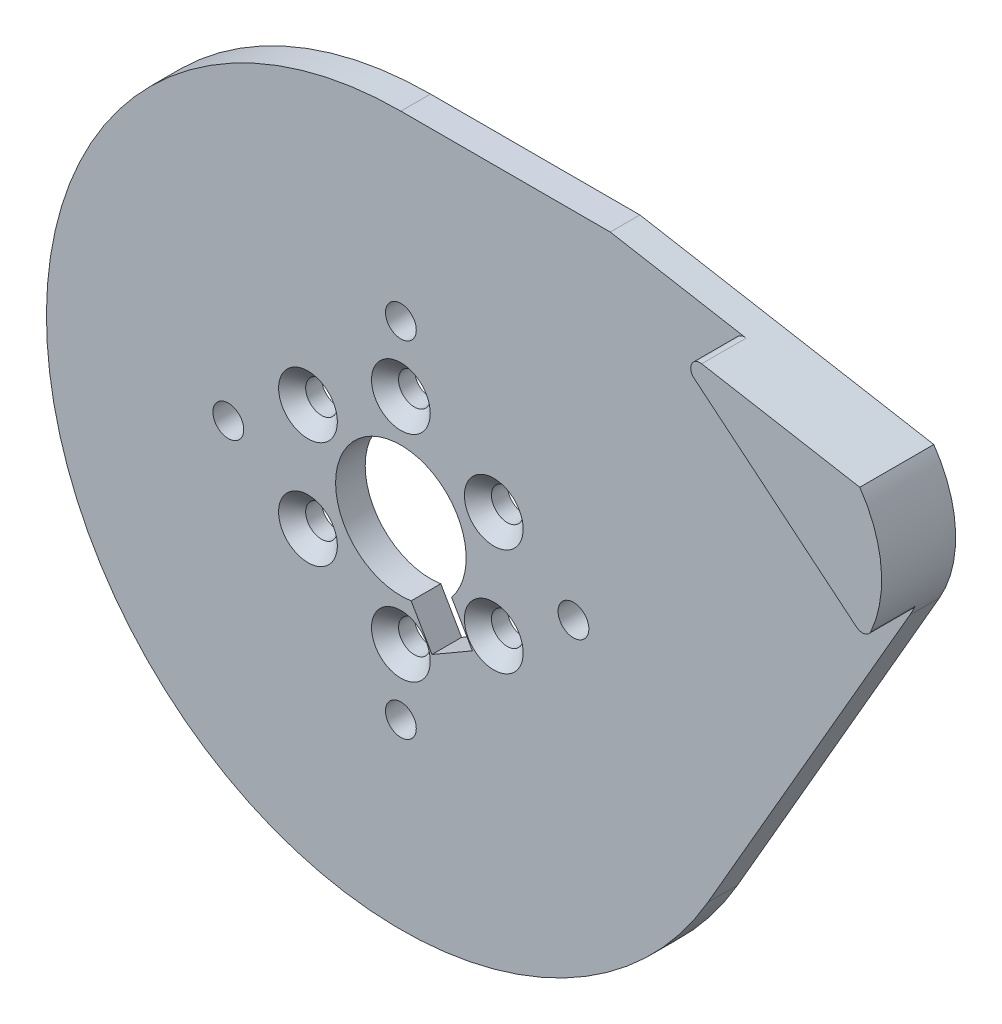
from build123d import *

# Parameters (mm, degrees)
BOSS_EXTRUDE1_DEPTH                               = 3.175
CUT_EXTRUDE1_DEPTH                                = 68.99936507
BOSS_EXTRUDE2_START                               = 4.7625
BOSS_EXTRUDE2_DEPTH                               = 4.7625
SKETCH4_W                                         = 7
SKETCH4_H                                         = 3.175
F_4_CLEARANCE_HOLE1_D                             = 3.3
CSK_FOR_4_FLAT_HEAD_MACHINE_SCREW_100_D           = 3.4
CSK_FOR_4_FLAT_HEAD_MACHINE_SCREW_100_CSINK_D     = 6.3
CSK_FOR_4_FLAT_HEAD_MACHINE_SCREW_100_CSINK_ANGLE = 90


with BuildPart() as part:
    # Sketch1 → Boss-Extrude1 (new body)
    with BuildSketch(Plane.XY.offset(3.175)):
        with BuildLine():
            Line((53.959502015, 32.443258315), (22.445653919, 38))
            Line((22.445653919, 38), (0, 38))
            ThreePointArc((0, 38), (-32.908965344, -19), (32.908965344, -19))
            Line((32.908965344, -19), (54.559600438, 18.5))
            ThreePointArc((54.559600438, 18.5), (56.289246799, 25.558984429), (53.959502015, 32.443258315))
        make_face()
    extrude(amount=-BOSS_EXTRUDE1_DEPTH)

    # Sketch2 → Cut-Extrude1 (cut, through all)
    with BuildSketch(Plane(origin=(0, 0, 0), x_dir=(-1, 0, 0), z_dir=(0, 0, -1))):
        with BuildLine():
            Line((-7.665063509, -8.276279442), (-3.334936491, -10.776279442))
            Line((-3.334936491, -10.776279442), (-1.104110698, -6.912375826))
            ThreePointArc((-1.104110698, -6.912375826), (-3.5, -6.062177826), (-5.434237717, -4.412375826))
            Line((-5.434237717, -4.412375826), (-7.665063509, -8.276279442))
        make_face()
    extrude(amount=-CUT_EXTRUDE1_DEPTH, mode=Mode.SUBTRACT)

    # Sketch3 → Boss-Extrude2 (add)
    with BuildSketch(Plane.XY.offset(3.175).offset(BOSS_EXTRUDE2_START)):
        with BuildLine():
            Line((37.009123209, 35.432067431), (53.959502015, 32.443258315))
            ThreePointArc((53.959502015, 32.443258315), (56.245337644, 26.204623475), (55.149967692, 19.651320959))
            ThreePointArc((55.149967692, 19.651320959), (54.46458083, 19.088642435), (53.601435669, 19.29197149))
            Line((53.601435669, 19.29197149), (36.198381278, 33.67647336))
            ThreePointArc((36.198381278, 33.67647336), (35.927607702, 34.866517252), (37.009123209, 35.432067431))
        make_face()
    extrude(amount=-BOSS_EXTRUDE2_DEPTH)

    # Sketch4 → Cut-Revolve1 (revolve, cut)
    with BuildSketch(Plane.XZ):
        with Locations((3.5, 1.5875)):
            Rectangle(SKETCH4_W, SKETCH4_H)
    revolve(axis=Axis((0, 0, 3.175), (0, 0, -1)), mode=Mode.SUBTRACT)

    # 4 Clearance Hole1 (through all)
    with Locations(Plane.XY.offset(3.175)):
        with Locations((18.5, 0), (0, -18.5), (-18.5, 0), (0, 18.5)):
            Hole(F_4_CLEARANCE_HOLE1_D / 2)

    # CSK for _4 Flat Head Machine Screw _100 (through all)
    with Locations(Plane.XY.offset(3.175)):
        with Locations((-9.959292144, 5.75), (-9.959292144, -5.75), (0, -11.5), (9.959292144, -5.75), (9.959292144, 5.75), (0, 11.5)):
            CounterSinkHole(CSK_FOR_4_FLAT_HEAD_MACHINE_SCREW_100_D / 2, CSK_FOR_4_FLAT_HEAD_MACHINE_SCREW_100_CSINK_D / 2, counter_sink_angle=CSK_FOR_4_FLAT_HEAD_MACHINE_SCREW_100_CSINK_ANGLE)


solid = part.part
